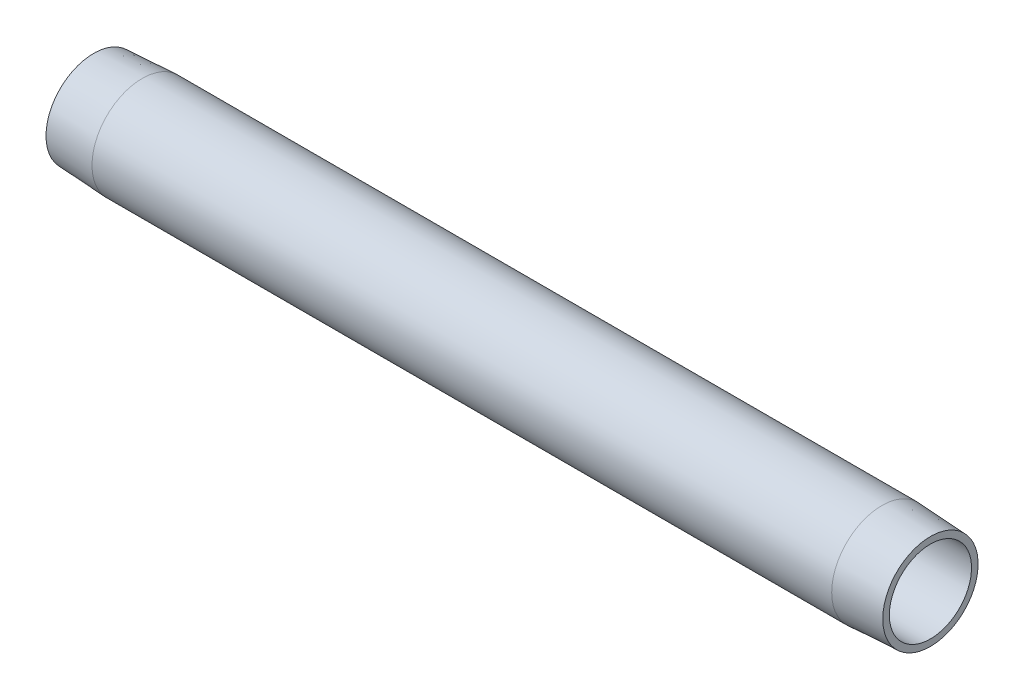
from build123d import *


with BuildPart() as part:
    # Sketch1 → Revolve1 (revolve)
    with BuildSketch(Plane.XY, mode=Mode.PRIVATE) as revolve1_sk:
        Polygon((177.8, 8.73125), (0, 8.73125), (0, 10.127550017), (10.3124, 10.668), (167.4876, 10.668), (177.8, 10.127550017), align=None)
    revolve(revolve1_sk.sketch.rotate(Axis((0, 0, 0), (1, 0, 0)), 90), axis=Axis((0, 0, 0), (1, 0, 0)))


solid = part.part
